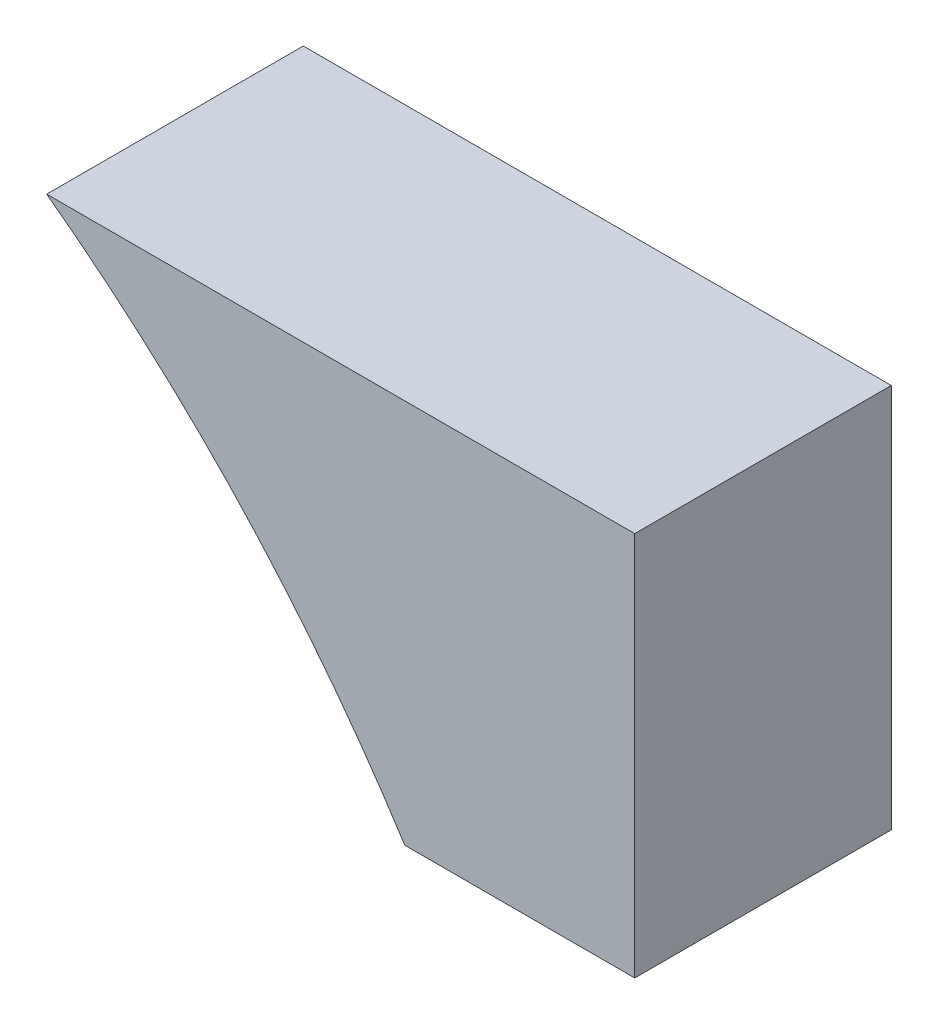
from build123d import *

# Parameters (mm, degrees)
EXTRUSION1_DEPTH = 20


with BuildPart() as part:
    # Esquisse1 → Extrusion1 (new body)
    with BuildSketch(Plane.XY):
        with BuildLine():
            Line((66.66333325, 90), (112.5, 90))
            Line((112.5, 90), (112.5, 60))
            Line((112.5, 60), (94.57272334, 60))
            ThreePointArc((94.57272334, 60), (82.0016249, 76.287177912), (66.66333325, 90))
        make_face()
    extrude(amount=EXTRUSION1_DEPTH)


solid = part.part
